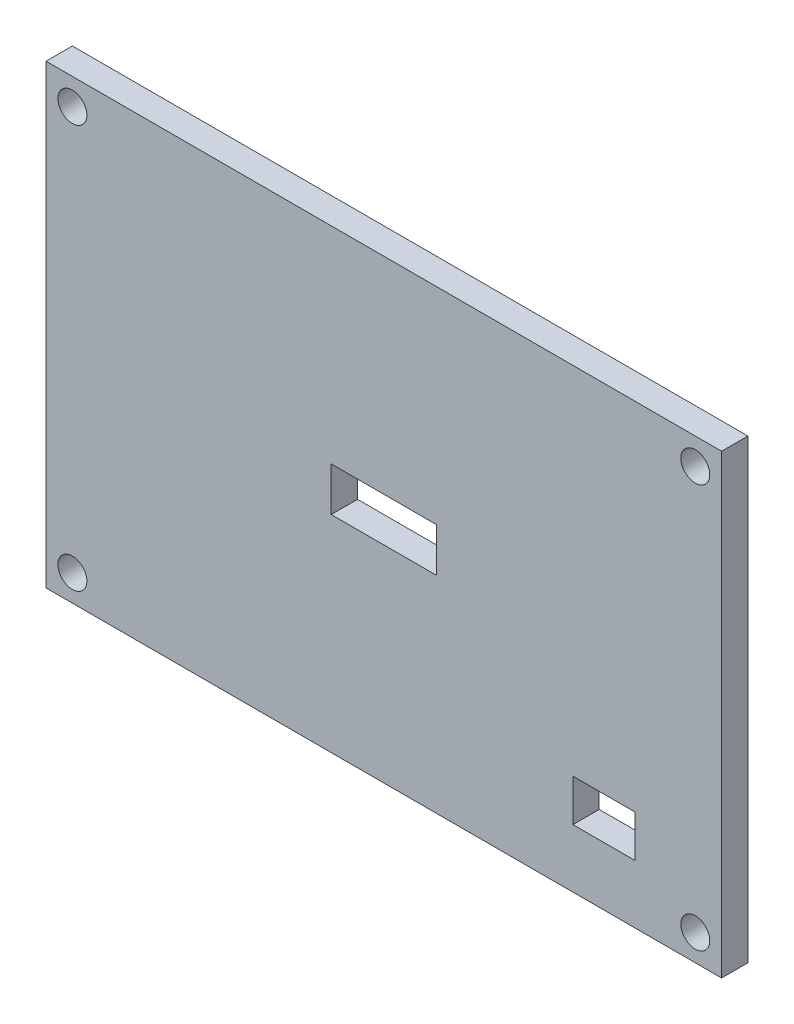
from build123d import *

# Parameters (mm, degrees)
CROQUIS1_W              = 77
CROQUIS1_H              = 52
CROQUIS1_R              = 1.65
CROQUIS1_W_2            = 12
CROQUIS1_H_2            = 5
CROQUIS1_W_3            = 7.080518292
CROQUIS1_H_3            = 4.781648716
SALIENTE_EXTRUIR1_DEPTH = 3


with BuildPart() as part:
    # Croquis1 → Saliente-Extruir1 (new body)
    with BuildSketch(Plane.XY):
        Rectangle(CROQUIS1_W, CROQUIS1_H)
        with Locations((-35.5, 23)):
            Circle(CROQUIS1_R, mode=Mode.SUBTRACT)
        with Locations(Location((35.5, 23, 0), (0, 0, 180))):
            Circle(CROQUIS1_R, mode=Mode.SUBTRACT)
        with Locations((35.5, -23)):
            Circle(CROQUIS1_R, mode=Mode.SUBTRACT)
        with Locations(Location((-35.5, -23, 0), (0, 0, 180))):
            Circle(CROQUIS1_R, mode=Mode.SUBTRACT)
        Rectangle(CROQUIS1_W_2, CROQUIS1_H_2, mode=Mode.SUBTRACT)
        with Locations((25.090033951, -16.943919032)):
            Rectangle(CROQUIS1_W_3, CROQUIS1_H_3, mode=Mode.SUBTRACT)
    extrude(amount=SALIENTE_EXTRUIR1_DEPTH)


solid = part.part
